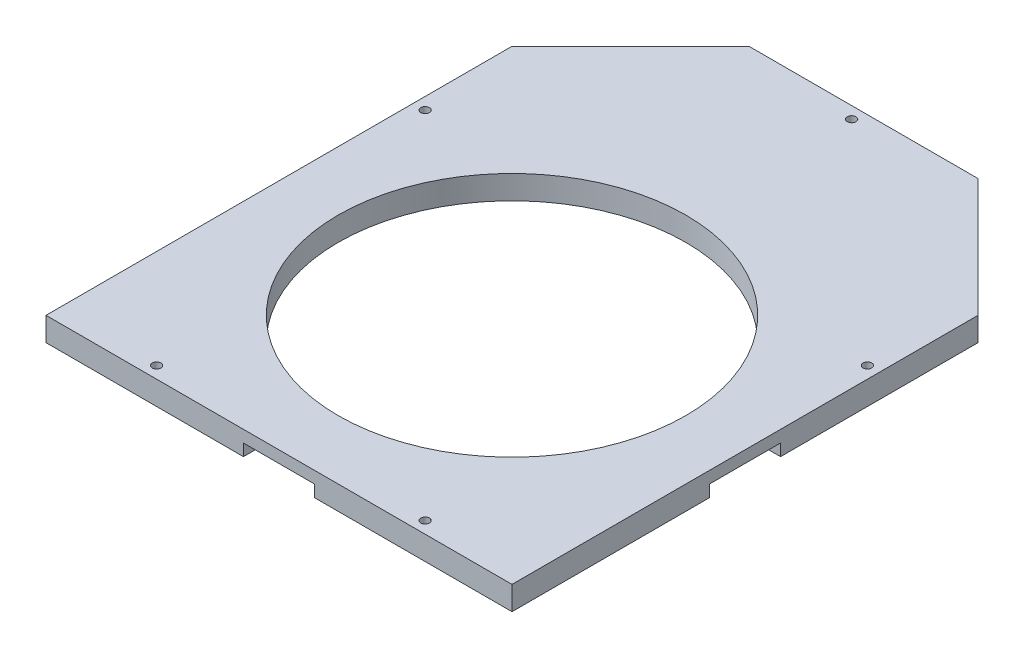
ISO-10303-21;
HEADER;
FILE_DESCRIPTION(('STEP AP214'),'2;1');
FILE_NAME('part.step','',(''),(''),'','','');
FILE_SCHEMA(('AUTOMOTIVE_DESIGN { 1 0 10303 214 1 1 1 1 }'));
ENDSEC;
DATA;
#1=APPLICATION_CONTEXT('core data for automotive mechanical design processes');
#2=APPLICATION_PROTOCOL_DEFINITION('international standard','automotive_design',2000,#1);
#3=PRODUCT_CONTEXT('',#1,'mechanical');
#4=PRODUCT('Part','Part','',(#3));
#5=PRODUCT_RELATED_PRODUCT_CATEGORY('part','',(#4));
#6=PRODUCT_DEFINITION_FORMATION('','',#4);
#7=PRODUCT_DEFINITION_CONTEXT('part definition',#1,'design');
#8=PRODUCT_DEFINITION('design','',#6,#7);
#9=PRODUCT_DEFINITION_SHAPE('','',#8);
#10=(LENGTH_UNIT() NAMED_UNIT(*) SI_UNIT(.MILLI.,.METRE.));
#11=(NAMED_UNIT(*) PLANE_ANGLE_UNIT() SI_UNIT($,.RADIAN.));
#12=(NAMED_UNIT(*) SI_UNIT($,.STERADIAN.) SOLID_ANGLE_UNIT());
#13=UNCERTAINTY_MEASURE_WITH_UNIT(LENGTH_MEASURE(1.E-05),#10,'distance_accuracy_value','');
#14=(GEOMETRIC_REPRESENTATION_CONTEXT(3) GLOBAL_UNCERTAINTY_ASSIGNED_CONTEXT((#13)) GLOBAL_UNIT_ASSIGNED_CONTEXT((#10,
#11,#12)) REPRESENTATION_CONTEXT('',''));
#15=CARTESIAN_POINT('',(0.,0.,0.));
#16=DIRECTION('',(0.,0.,1.));
#17=DIRECTION('',(1.,0.,0.));
#18=AXIS2_PLACEMENT_3D('',#15,#16,#17);
#19=CARTESIAN_POINT('',(0.,0.,0.));
#20=DIRECTION('',(0.,1.,0.));
#21=DIRECTION('',(0.,0.,1.));
#22=AXIS2_PLACEMENT_3D('',#19,#20,#21);
#23=PLANE('',#22);
#24=CARTESIAN_POINT('',(0.,0.,-86.));
#25=DIRECTION('',(0.,1.,0.));
#26=DIRECTION('',(0.,0.,1.));
#27=AXIS2_PLACEMENT_3D('',#24,#25,#26);
#28=CIRCLE('',#27,1.1);
#29=CARTESIAN_POINT('',(0.,0.,-84.9));
#30=VERTEX_POINT('',#29);
#31=EDGE_CURVE('E291',#30,#30,#28,.T.);
#32=ORIENTED_EDGE('',*,*,#31,.T.);
#33=EDGE_LOOP('',(#32));
#34=FACE_BOUND('',#33,.T.);
#35=CARTESIAN_POINT('',(-33.9999999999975,0.,55.9999999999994));
#36=DIRECTION('',(0.,1.,0.));
#37=DIRECTION('',(0.,0.,1.));
#38=AXIS2_PLACEMENT_3D('',#35,#36,#37);
#39=CIRCLE('',#38,1.10000000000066);
#40=CARTESIAN_POINT('',(-33.9999999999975,0.,57.1));
#41=VERTEX_POINT('',#40);
#42=EDGE_CURVE('E295',#41,#41,#39,.T.);
#43=ORIENTED_EDGE('',*,*,#42,.T.);
#44=EDGE_LOOP('',(#43));
#45=FACE_BOUND('',#44,.T.);
#46=CARTESIAN_POINT('',(56.,0.,-34.));
#47=DIRECTION('',(0.,1.,0.));
#48=DIRECTION('',(0.,0.,-1.));
#49=AXIS2_PLACEMENT_3D('',#46,#47,#48);
#50=CIRCLE('',#49,1.1);
#51=CARTESIAN_POINT('',(56.,0.,-35.1));
#52=VERTEX_POINT('',#51);
#53=EDGE_CURVE('E301',#52,#52,#50,.T.);
#54=ORIENTED_EDGE('',*,*,#53,.T.);
#55=EDGE_LOOP('',(#54));
#56=FACE_BOUND('',#55,.T.);
#57=CARTESIAN_POINT('',(33.9999999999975,0.,55.9999999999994));
#58=DIRECTION('',(0.,1.,0.));
#59=DIRECTION('',(0.,0.,-1.));
#60=AXIS2_PLACEMENT_3D('',#57,#58,#59);
#61=CIRCLE('',#60,1.10000000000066);
#62=CARTESIAN_POINT('',(33.9999999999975,0.,54.8999999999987));
#63=VERTEX_POINT('',#62);
#64=EDGE_CURVE('E307',#63,#63,#61,.T.);
#65=ORIENTED_EDGE('',*,*,#64,.T.);
#66=EDGE_LOOP('',(#65));
#67=FACE_BOUND('',#66,.T.);
#68=CARTESIAN_POINT('',(-56.,0.,-34.));
#69=DIRECTION('',(0.,1.,0.));
#70=DIRECTION('',(0.,0.,1.));
#71=AXIS2_PLACEMENT_3D('',#68,#69,#70);
#72=CIRCLE('',#71,1.1);
#73=CARTESIAN_POINT('',(-56.,0.,-32.9));
#74=VERTEX_POINT('',#73);
#75=EDGE_CURVE('E313',#74,#74,#72,.T.);
#76=ORIENTED_EDGE('',*,*,#75,.T.);
#77=EDGE_LOOP('',(#76));
#78=FACE_BOUND('',#77,.T.);
#79=CARTESIAN_POINT('',(0.,0.,0.));
#80=DIRECTION('',(0.,1.,0.));
#81=DIRECTION('',(0.,0.,1.));
#82=AXIS2_PLACEMENT_3D('',#79,#80,#81);
#83=CIRCLE('',#82,44.);
#84=CARTESIAN_POINT('',(0.,0.,44.));
#85=VERTEX_POINT('',#84);
#86=EDGE_CURVE('E319',#85,#85,#83,.T.);
#87=ORIENTED_EDGE('',*,*,#86,.T.);
#88=EDGE_LOOP('',(#87));
#89=FACE_BOUND('',#88,.T.);
#90=DIRECTION('',(-1.,0.,0.));
#91=VECTOR('',#90,1.);
#92=CARTESIAN_POINT('',(-55.2627416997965,0.,-9.00000000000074));
#93=LINE('',#92,#91);
#94=CARTESIAN_POINT('',(-55.2627416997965,0.,-9.00000000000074));
#95=VERTEX_POINT('',#94);
#96=CARTESIAN_POINT('',(-59.,0.,-9.00000000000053));
#97=VERTEX_POINT('',#96);
#98=EDGE_CURVE('E418',#95,#97,#93,.T.);
#99=ORIENTED_EDGE('',*,*,#98,.T.);
#100=DIRECTION('',(0.,0.,1.));
#101=VECTOR('',#100,1.);
#102=CARTESIAN_POINT('',(-59.,0.,-59.));
#103=LINE('',#102,#101);
#104=CARTESIAN_POINT('',(-59.,0.,-59.));
#105=VERTEX_POINT('',#104);
#106=EDGE_CURVE('E353',#105,#97,#103,.T.);
#107=ORIENTED_EDGE('',*,*,#106,.F.);
#108=DIRECTION('',(-0.707106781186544,0.,0.707106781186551));
#109=VECTOR('',#108,1.);
#110=CARTESIAN_POINT('',(-59.,0.,-59.));
#111=LINE('',#110,#109);
#112=CARTESIAN_POINT('',(-29.0000000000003,0.,-89.));
#113=VERTEX_POINT('',#112);
#114=EDGE_CURVE('E350',#113,#105,#111,.T.);
#115=ORIENTED_EDGE('',*,*,#114,.F.);
#116=DIRECTION('',(-1.,0.,0.));
#117=VECTOR('',#116,1.);
#118=CARTESIAN_POINT('',(-29.0000000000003,0.,-89.));
#119=LINE('',#118,#117);
#120=CARTESIAN_POINT('',(29.0000000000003,0.,-89.));
#121=VERTEX_POINT('',#120);
#122=EDGE_CURVE('E348',#121,#113,#119,.T.);
#123=ORIENTED_EDGE('',*,*,#122,.F.);
#124=DIRECTION('',(-0.707106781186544,0.,-0.707106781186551));
#125=VECTOR('',#124,1.);
#126=CARTESIAN_POINT('',(59.,0.,-59.));
#127=LINE('',#126,#125);
#128=CARTESIAN_POINT('',(59.,0.,-59.));
#129=VERTEX_POINT('',#128);
#130=EDGE_CURVE('E346',#129,#121,#127,.T.);
#131=ORIENTED_EDGE('',*,*,#130,.F.);
#132=DIRECTION('',(0.,0.,-1.));
#133=VECTOR('',#132,1.);
#134=CARTESIAN_POINT('',(59.,0.,-59.));
#135=LINE('',#134,#133);
#136=CARTESIAN_POINT('',(59.,0.,-9.));
#137=VERTEX_POINT('',#136);
#138=EDGE_CURVE('E325',#137,#129,#135,.T.);
#139=ORIENTED_EDGE('',*,*,#138,.F.);
#140=DIRECTION('',(-1.,0.,0.));
#141=VECTOR('',#140,1.);
#142=CARTESIAN_POINT('',(55.2627416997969,0.,-8.99999999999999));
#143=LINE('',#142,#141);
#144=CARTESIAN_POINT('',(55.2627416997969,0.,-8.99999999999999));
#145=VERTEX_POINT('',#144);
#146=EDGE_CURVE('E260',#137,#145,#143,.T.);
#147=ORIENTED_EDGE('',*,*,#146,.T.);
#148=CARTESIAN_POINT('',(54.1313708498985,0.,-7.86862915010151));
#149=DIRECTION('',(0.,1.,0.));
#150=DIRECTION('',(0.,0.,1.));
#151=AXIS2_PLACEMENT_3D('',#148,#149,#150);
#152=CIRCLE('',#151,1.6);
#153=CARTESIAN_POINT('',(53.,0.,-6.73725830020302));
#154=VERTEX_POINT('',#153);
#155=EDGE_CURVE('E255',#145,#154,#152,.T.);
#156=ORIENTED_EDGE('',*,*,#155,.T.);
#157=DIRECTION('',(0.,0.,1.));
#158=VECTOR('',#157,1.);
#159=CARTESIAN_POINT('',(53.,0.,-6.73725830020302));
#160=LINE('',#159,#158);
#161=CARTESIAN_POINT('',(53.,0.,6.73725830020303));
#162=VERTEX_POINT('',#161);
#163=EDGE_CURVE('E272',#154,#162,#160,.T.);
#164=ORIENTED_EDGE('',*,*,#163,.T.);
#165=CARTESIAN_POINT('',(54.1313708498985,0.,7.86862915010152));
#166=DIRECTION('',(0.,1.,0.));
#167=DIRECTION('',(0.,0.,-1.));
#168=AXIS2_PLACEMENT_3D('',#165,#166,#167);
#169=CIRCLE('',#168,1.6);
#170=CARTESIAN_POINT('',(55.2627416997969,0.,9.00000000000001));
#171=VERTEX_POINT('',#170);
#172=EDGE_CURVE('E275',#162,#171,#169,.T.);
#173=ORIENTED_EDGE('',*,*,#172,.T.);
#174=DIRECTION('',(1.,0.,0.));
#175=VECTOR('',#174,1.);
#176=CARTESIAN_POINT('',(55.2627416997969,0.,9.00000000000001));
#177=LINE('',#176,#175);
#178=CARTESIAN_POINT('',(59.,0.,9.));
#179=VERTEX_POINT('',#178);
#180=EDGE_CURVE('E278',#171,#179,#177,.T.);
#181=ORIENTED_EDGE('',*,*,#180,.T.);
#182=CARTESIAN_POINT('',(59.,0.,59.));
#183=VERTEX_POINT('',#182);
#184=EDGE_CURVE('E343',#183,#179,#135,.T.);
#185=ORIENTED_EDGE('',*,*,#184,.F.);
#186=DIRECTION('',(1.,0.,0.));
#187=VECTOR('',#186,1.);
#188=CARTESIAN_POINT('',(-59.,0.,59.));
#189=LINE('',#188,#187);
#190=CARTESIAN_POINT('',(8.9999999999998,0.,59.));
#191=VERTEX_POINT('',#190);
#192=EDGE_CURVE('E356',#191,#183,#189,.T.);
#193=ORIENTED_EDGE('',*,*,#192,.F.);
#194=DIRECTION('',(0.,0.,-1.));
#195=VECTOR('',#194,1.);
#196=CARTESIAN_POINT('',(8.99999999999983,0.,55.2627416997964));
#197=LINE('',#196,#195);
#198=CARTESIAN_POINT('',(8.99999999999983,0.,55.2627416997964));
#199=VERTEX_POINT('',#198);
#200=EDGE_CURVE('E228',#191,#199,#197,.T.);
#201=ORIENTED_EDGE('',*,*,#200,.T.);
#202=CARTESIAN_POINT('',(7.86862915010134,0.,54.1313708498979));
#203=DIRECTION('',(0.,1.,0.));
#204=DIRECTION('',(0.,0.,1.));
#205=AXIS2_PLACEMENT_3D('',#202,#203,#204);
#206=CIRCLE('',#205,1.6);
#207=CARTESIAN_POINT('',(6.73725830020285,0.,52.9999999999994));
#208=VERTEX_POINT('',#207);
#209=EDGE_CURVE('E214',#199,#208,#206,.T.);
#210=ORIENTED_EDGE('',*,*,#209,.T.);
#211=DIRECTION('',(-1.,0.,0.));
#212=VECTOR('',#211,1.);
#213=CARTESIAN_POINT('',(6.73725830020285,0.,52.9999999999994));
#214=LINE('',#213,#212);
#215=CARTESIAN_POINT('',(-6.7372583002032,0.,52.9999999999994));
#216=VERTEX_POINT('',#215);
#217=EDGE_CURVE('E218',#208,#216,#214,.T.);
#218=ORIENTED_EDGE('',*,*,#217,.T.);
#219=CARTESIAN_POINT('',(-7.86862915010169,0.,54.1313708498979));
#220=DIRECTION('',(0.,1.,0.));
#221=DIRECTION('',(0.,0.,-1.));
#222=AXIS2_PLACEMENT_3D('',#219,#220,#221);
#223=CIRCLE('',#222,1.6);
#224=CARTESIAN_POINT('',(-9.00000000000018,0.,55.2627416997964));
#225=VERTEX_POINT('',#224);
#226=EDGE_CURVE('E239',#216,#225,#223,.T.);
#227=ORIENTED_EDGE('',*,*,#226,.T.);
#228=DIRECTION('',(0.,0.,1.));
#229=VECTOR('',#228,1.);
#230=CARTESIAN_POINT('',(-9.00000000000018,0.,55.2627416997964));
#231=LINE('',#230,#229);
#232=CARTESIAN_POINT('',(-9.0000000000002,0.,59.));
#233=VERTEX_POINT('',#232);
#234=EDGE_CURVE('E242',#225,#233,#231,.T.);
#235=ORIENTED_EDGE('',*,*,#234,.T.);
#236=CARTESIAN_POINT('',(-59.,0.,59.));
#237=VERTEX_POINT('',#236);
#238=EDGE_CURVE('E332',#237,#233,#189,.T.);
#239=ORIENTED_EDGE('',*,*,#238,.F.);
#240=CARTESIAN_POINT('',(-59.,0.,8.99999999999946));
#241=VERTEX_POINT('',#240);
#242=EDGE_CURVE('E352',#241,#237,#103,.T.);
#243=ORIENTED_EDGE('',*,*,#242,.F.);
#244=DIRECTION('',(1.,0.,0.));
#245=VECTOR('',#244,1.);
#246=CARTESIAN_POINT('',(-55.2627416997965,0.,8.99999999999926));
#247=LINE('',#246,#245);
#248=CARTESIAN_POINT('',(-55.2627416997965,0.,8.99999999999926));
#249=VERTEX_POINT('',#248);
#250=EDGE_CURVE('E209',#241,#249,#247,.T.);
#251=ORIENTED_EDGE('',*,*,#250,.T.);
#252=CARTESIAN_POINT('',(-54.1313708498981,0.,7.86862915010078));
#253=DIRECTION('',(0.,1.,0.));
#254=DIRECTION('',(0.,0.,1.));
#255=AXIS2_PLACEMENT_3D('',#252,#253,#254);
#256=CIRCLE('',#255,1.6);
#257=CARTESIAN_POINT('',(-52.9999999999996,0.,6.73725830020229));
#258=VERTEX_POINT('',#257);
#259=EDGE_CURVE('E412',#249,#258,#256,.T.);
#260=ORIENTED_EDGE('',*,*,#259,.T.);
#261=DIRECTION('',(0.,0.,-1.));
#262=VECTOR('',#261,1.);
#263=CARTESIAN_POINT('',(-52.9999999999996,0.,6.73725830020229));
#264=LINE('',#263,#262);
#265=CARTESIAN_POINT('',(-52.9999999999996,0.,-6.73725830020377));
#266=VERTEX_POINT('',#265);
#267=EDGE_CURVE('E213',#258,#266,#264,.T.);
#268=ORIENTED_EDGE('',*,*,#267,.T.);
#269=CARTESIAN_POINT('',(-54.1313708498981,0.,-7.86862915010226));
#270=DIRECTION('',(0.,1.,0.));
#271=DIRECTION('',(0.,0.,-1.));
#272=AXIS2_PLACEMENT_3D('',#269,#270,#271);
#273=CIRCLE('',#272,1.6);
#274=EDGE_CURVE('E415',#266,#95,#273,.T.);
#275=ORIENTED_EDGE('',*,*,#274,.T.);
#276=EDGE_LOOP('',(#99,#107,#115,#123,#131,#139,#147,#156,#164,#173,#181,#185,#193,#201,#210,
#218,#227,#235,#239,#243,#251,#260,#268,#275));
#277=FACE_BOUND('',#276,.T.);
#278=ADVANCED_FACE('F33',(#34,#45,#56,#67,#78,#89,#277),#23,.F.);
#279=CARTESIAN_POINT('',(-59.,6.,-59.));
#280=DIRECTION('',(1.,0.,0.));
#281=DIRECTION('',(0.,0.,-1.));
#282=AXIS2_PLACEMENT_3D('',#279,#280,#281);
#283=PLANE('',#282);
#284=DIRECTION('',(0.,-1.,0.));
#285=VECTOR('',#284,1.);
#286=CARTESIAN_POINT('',(-59.,6.,-9.00000000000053));
#287=LINE('',#286,#285);
#288=CARTESIAN_POINT('',(-59.,3.,-9.00000000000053));
#289=VERTEX_POINT('',#288);
#290=EDGE_CURVE('E11',#289,#97,#287,.T.);
#291=ORIENTED_EDGE('',*,*,#290,.F.);
#292=DIRECTION('',(0.,0.,1.));
#293=VECTOR('',#292,1.);
#294=CARTESIAN_POINT('',(-59.,3.,-59.));
#295=LINE('',#294,#293);
#296=CARTESIAN_POINT('',(-59.,3.,8.99999999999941));
#297=VERTEX_POINT('',#296);
#298=EDGE_CURVE('E391',#289,#297,#295,.T.);
#299=ORIENTED_EDGE('',*,*,#298,.T.);
#300=DIRECTION('',(0.,1.,0.));
#301=VECTOR('',#300,1.);
#302=CARTESIAN_POINT('',(-59.,6.,8.99999999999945));
#303=LINE('',#302,#301);
#304=EDGE_CURVE('E41',#241,#297,#303,.T.);
#305=ORIENTED_EDGE('',*,*,#304,.F.);
#306=ORIENTED_EDGE('',*,*,#242,.T.);
#307=DIRECTION('',(0.,-1.,0.));
#308=VECTOR('',#307,1.);
#309=CARTESIAN_POINT('',(-59.,6.,59.));
#310=LINE('',#309,#308);
#311=CARTESIAN_POINT('',(-59.,6.,59.));
#312=VERTEX_POINT('',#311);
#313=EDGE_CURVE('E361',#312,#237,#310,.T.);
#314=ORIENTED_EDGE('',*,*,#313,.F.);
#315=DIRECTION('',(0.,0.,1.));
#316=VECTOR('',#315,1.);
#317=CARTESIAN_POINT('',(-59.,6.,-59.));
#318=LINE('',#317,#316);
#319=CARTESIAN_POINT('',(-59.,6.,-59.));
#320=VERTEX_POINT('',#319);
#321=EDGE_CURVE('E338',#320,#312,#318,.T.);
#322=ORIENTED_EDGE('',*,*,#321,.F.);
#323=DIRECTION('',(0.,-1.,0.));
#324=VECTOR('',#323,1.);
#325=CARTESIAN_POINT('',(-59.,6.,-59.));
#326=LINE('',#325,#324);
#327=EDGE_CURVE('E364',#320,#105,#326,.T.);
#328=ORIENTED_EDGE('',*,*,#327,.T.);
#329=ORIENTED_EDGE('',*,*,#106,.T.);
#330=EDGE_LOOP('',(#291,#299,#305,#306,#314,#322,#328,#329));
#331=FACE_BOUND('',#330,.T.);
#332=ADVANCED_FACE('F400',(#331),#283,.F.);
#333=CARTESIAN_POINT('',(-59.,6.,59.));
#334=DIRECTION('',(0.,0.,-1.));
#335=DIRECTION('',(-1.,0.,0.));
#336=AXIS2_PLACEMENT_3D('',#333,#334,#335);
#337=PLANE('',#336);
#338=DIRECTION('',(0.,-1.,0.));
#339=VECTOR('',#338,1.);
#340=CARTESIAN_POINT('',(-9.0000000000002,6.,59.));
#341=LINE('',#340,#339);
#342=CARTESIAN_POINT('',(-9.0000000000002,3.,59.));
#343=VERTEX_POINT('',#342);
#344=EDGE_CURVE('E389',#343,#233,#341,.T.);
#345=ORIENTED_EDGE('',*,*,#344,.F.);
#346=DIRECTION('',(1.,0.,0.));
#347=VECTOR('',#346,1.);
#348=CARTESIAN_POINT('',(-59.,3.,59.));
#349=LINE('',#348,#347);
#350=CARTESIAN_POINT('',(8.9999999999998,3.,59.));
#351=VERTEX_POINT('',#350);
#352=EDGE_CURVE('E384',#343,#351,#349,.T.);
#353=ORIENTED_EDGE('',*,*,#352,.T.);
#354=DIRECTION('',(0.,1.,0.));
#355=VECTOR('',#354,1.);
#356=CARTESIAN_POINT('',(8.9999999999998,6.,59.));
#357=LINE('',#356,#355);
#358=EDGE_CURVE('E387',#191,#351,#357,.T.);
#359=ORIENTED_EDGE('',*,*,#358,.F.);
#360=ORIENTED_EDGE('',*,*,#192,.T.);
#361=DIRECTION('',(0.,-1.,0.));
#362=VECTOR('',#361,1.);
#363=CARTESIAN_POINT('',(59.,6.,59.));
#364=LINE('',#363,#362);
#365=CARTESIAN_POINT('',(59.,6.,59.));
#366=VERTEX_POINT('',#365);
#367=EDGE_CURVE('E342',#366,#183,#364,.T.);
#368=ORIENTED_EDGE('',*,*,#367,.F.);
#369=DIRECTION('',(1.,0.,0.));
#370=VECTOR('',#369,1.);
#371=CARTESIAN_POINT('',(-59.,6.,59.));
#372=LINE('',#371,#370);
#373=EDGE_CURVE('E340',#312,#366,#372,.T.);
#374=ORIENTED_EDGE('',*,*,#373,.F.);
#375=ORIENTED_EDGE('',*,*,#313,.T.);
#376=ORIENTED_EDGE('',*,*,#238,.T.);
#377=EDGE_LOOP('',(#345,#353,#359,#360,#368,#374,#375,#376));
#378=FACE_BOUND('',#377,.T.);
#379=ADVANCED_FACE('F432',(#378),#337,.F.);
#380=CARTESIAN_POINT('',(59.,6.,-59.));
#381=DIRECTION('',(-1.,0.,0.));
#382=DIRECTION('',(0.,0.,1.));
#383=AXIS2_PLACEMENT_3D('',#380,#381,#382);
#384=PLANE('',#383);
#385=DIRECTION('',(0.,-1.,0.));
#386=VECTOR('',#385,1.);
#387=CARTESIAN_POINT('',(59.,6.,9.00000000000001));
#388=LINE('',#387,#386);
#389=CARTESIAN_POINT('',(59.,3.,9.));
#390=VERTEX_POINT('',#389);
#391=EDGE_CURVE('E382',#390,#179,#388,.T.);
#392=ORIENTED_EDGE('',*,*,#391,.F.);
#393=DIRECTION('',(0.,0.,-1.));
#394=VECTOR('',#393,1.);
#395=CARTESIAN_POINT('',(59.,3.,-59.));
#396=LINE('',#395,#394);
#397=CARTESIAN_POINT('',(59.,3.,-8.99999999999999));
#398=VERTEX_POINT('',#397);
#399=EDGE_CURVE('E376',#390,#398,#396,.T.);
#400=ORIENTED_EDGE('',*,*,#399,.T.);
#401=DIRECTION('',(0.,1.,0.));
#402=VECTOR('',#401,1.);
#403=CARTESIAN_POINT('',(59.,6.,-8.99999999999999));
#404=LINE('',#403,#402);
#405=EDGE_CURVE('E379',#137,#398,#404,.T.);
#406=ORIENTED_EDGE('',*,*,#405,.F.);
#407=ORIENTED_EDGE('',*,*,#138,.T.);
#408=DIRECTION('',(0.,-1.,0.));
#409=VECTOR('',#408,1.);
#410=CARTESIAN_POINT('',(59.,6.,-59.));
#411=LINE('',#410,#409);
#412=CARTESIAN_POINT('',(59.,6.,-59.));
#413=VERTEX_POINT('',#412);
#414=EDGE_CURVE('E373',#413,#129,#411,.T.);
#415=ORIENTED_EDGE('',*,*,#414,.F.);
#416=DIRECTION('',(0.,0.,-1.));
#417=VECTOR('',#416,1.);
#418=CARTESIAN_POINT('',(59.,6.,-59.));
#419=LINE('',#418,#417);
#420=EDGE_CURVE('E328',#366,#413,#419,.T.);
#421=ORIENTED_EDGE('',*,*,#420,.F.);
#422=ORIENTED_EDGE('',*,*,#367,.T.);
#423=ORIENTED_EDGE('',*,*,#184,.T.);
#424=EDGE_LOOP('',(#392,#400,#406,#407,#415,#421,#422,#423));
#425=FACE_BOUND('',#424,.T.);
#426=ADVANCED_FACE('F35',(#425),#384,.F.);
#427=CARTESIAN_POINT('',(0.,6.,0.));
#428=DIRECTION('',(0.,1.,0.));
#429=DIRECTION('',(0.,0.,1.));
#430=AXIS2_PLACEMENT_3D('',#427,#428,#429);
#431=PLANE('',#430);
#432=CARTESIAN_POINT('',(-33.9999999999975,6.,55.9999999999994));
#433=DIRECTION('',(0.,1.,0.));
#434=DIRECTION('',(0.,0.,1.));
#435=AXIS2_PLACEMENT_3D('',#432,#433,#434);
#436=CIRCLE('',#435,1.10000000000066);
#437=CARTESIAN_POINT('',(-33.9999999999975,6.,57.1));
#438=VERTEX_POINT('',#437);
#439=EDGE_CURVE('E298',#438,#438,#436,.T.);
#440=ORIENTED_EDGE('',*,*,#439,.F.);
#441=EDGE_LOOP('',(#440));
#442=FACE_BOUND('',#441,.T.);
#443=CARTESIAN_POINT('',(33.9999999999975,6.,55.9999999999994));
#444=DIRECTION('',(0.,1.,0.));
#445=DIRECTION('',(0.,0.,-1.));
#446=AXIS2_PLACEMENT_3D('',#443,#444,#445);
#447=CIRCLE('',#446,1.10000000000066);
#448=CARTESIAN_POINT('',(33.9999999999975,6.,54.8999999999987));
#449=VERTEX_POINT('',#448);
#450=EDGE_CURVE('E310',#449,#449,#447,.T.);
#451=ORIENTED_EDGE('',*,*,#450,.F.);
#452=EDGE_LOOP('',(#451));
#453=FACE_BOUND('',#452,.T.);
#454=CARTESIAN_POINT('',(0.,6.,0.));
#455=DIRECTION('',(0.,1.,0.));
#456=DIRECTION('',(0.,0.,1.));
#457=AXIS2_PLACEMENT_3D('',#454,#455,#456);
#458=CIRCLE('',#457,44.);
#459=CARTESIAN_POINT('',(0.,6.,44.));
#460=VERTEX_POINT('',#459);
#461=EDGE_CURVE('E322',#460,#460,#458,.T.);
#462=ORIENTED_EDGE('',*,*,#461,.F.);
#463=EDGE_LOOP('',(#462));
#464=FACE_BOUND('',#463,.T.);
#465=ORIENTED_EDGE('',*,*,#420,.T.);
#466=DIRECTION('',(-0.707106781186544,0.,-0.707106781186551));
#467=VECTOR('',#466,1.);
#468=CARTESIAN_POINT('',(59.,6.,-59.));
#469=LINE('',#468,#467);
#470=CARTESIAN_POINT('',(29.0000000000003,6.,-89.));
#471=VERTEX_POINT('',#470);
#472=EDGE_CURVE('E331',#413,#471,#469,.T.);
#473=ORIENTED_EDGE('',*,*,#472,.T.);
#474=DIRECTION('',(-1.,0.,0.));
#475=VECTOR('',#474,1.);
#476=CARTESIAN_POINT('',(-29.0000000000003,6.,-89.));
#477=LINE('',#476,#475);
#478=CARTESIAN_POINT('',(-29.0000000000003,6.,-89.));
#479=VERTEX_POINT('',#478);
#480=EDGE_CURVE('E334',#471,#479,#477,.T.);
#481=ORIENTED_EDGE('',*,*,#480,.T.);
#482=DIRECTION('',(-0.707106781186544,0.,0.707106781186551));
#483=VECTOR('',#482,1.);
#484=CARTESIAN_POINT('',(-59.,6.,-59.));
#485=LINE('',#484,#483);
#486=EDGE_CURVE('E336',#479,#320,#485,.T.);
#487=ORIENTED_EDGE('',*,*,#486,.T.);
#488=ORIENTED_EDGE('',*,*,#321,.T.);
#489=ORIENTED_EDGE('',*,*,#373,.T.);
#490=EDGE_LOOP('',(#465,#473,#481,#487,#488,#489));
#491=FACE_BOUND('',#490,.T.);
#492=CARTESIAN_POINT('',(-56.,6.,-34.));
#493=DIRECTION('',(0.,1.,0.));
#494=DIRECTION('',(0.,0.,1.));
#495=AXIS2_PLACEMENT_3D('',#492,#493,#494);
#496=CIRCLE('',#495,1.1);
#497=CARTESIAN_POINT('',(-56.,6.,-32.9));
#498=VERTEX_POINT('',#497);
#499=EDGE_CURVE('E316',#498,#498,#496,.T.);
#500=ORIENTED_EDGE('',*,*,#499,.F.);
#501=EDGE_LOOP('',(#500));
#502=FACE_BOUND('',#501,.T.);
#503=CARTESIAN_POINT('',(56.,6.,-34.));
#504=DIRECTION('',(0.,1.,0.));
#505=DIRECTION('',(0.,0.,-1.));
#506=AXIS2_PLACEMENT_3D('',#503,#504,#505);
#507=CIRCLE('',#506,1.1);
#508=CARTESIAN_POINT('',(56.,6.,-35.1));
#509=VERTEX_POINT('',#508);
#510=EDGE_CURVE('E304',#509,#509,#507,.T.);
#511=ORIENTED_EDGE('',*,*,#510,.F.);
#512=EDGE_LOOP('',(#511));
#513=FACE_BOUND('',#512,.T.);
#514=CARTESIAN_POINT('',(0.,6.,-86.));
#515=DIRECTION('',(0.,1.,0.));
#516=DIRECTION('',(0.,0.,1.));
#517=AXIS2_PLACEMENT_3D('',#514,#515,#516);
#518=CIRCLE('',#517,1.1);
#519=CARTESIAN_POINT('',(0.,6.,-84.9));
#520=VERTEX_POINT('',#519);
#521=EDGE_CURVE('E292',#520,#520,#518,.T.);
#522=ORIENTED_EDGE('',*,*,#521,.F.);
#523=EDGE_LOOP('',(#522));
#524=FACE_BOUND('',#523,.T.);
#525=ADVANCED_FACE('F436',(#442,#453,#464,#491,#502,#513,#524),#431,.T.);
#526=CARTESIAN_POINT('',(59.,6.,-59.));
#527=DIRECTION('',(-0.707106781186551,0.,0.707106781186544));
#528=DIRECTION('',(0.707106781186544,0.,0.707106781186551));
#529=AXIS2_PLACEMENT_3D('',#526,#527,#528);
#530=PLANE('',#529);
#531=ORIENTED_EDGE('',*,*,#130,.T.);
#532=DIRECTION('',(0.,-1.,0.));
#533=VECTOR('',#532,1.);
#534=CARTESIAN_POINT('',(29.0000000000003,6.,-89.));
#535=LINE('',#534,#533);
#536=EDGE_CURVE('E370',#471,#121,#535,.T.);
#537=ORIENTED_EDGE('',*,*,#536,.F.);
#538=ORIENTED_EDGE('',*,*,#472,.F.);
#539=ORIENTED_EDGE('',*,*,#414,.T.);
#540=EDGE_LOOP('',(#531,#537,#538,#539));
#541=FACE_BOUND('',#540,.T.);
#542=ADVANCED_FACE('F452',(#541),#530,.F.);
#543=CARTESIAN_POINT('',(-29.0000000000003,6.,-89.));
#544=DIRECTION('',(0.,0.,1.));
#545=DIRECTION('',(1.,0.,0.));
#546=AXIS2_PLACEMENT_3D('',#543,#544,#545);
#547=PLANE('',#546);
#548=ORIENTED_EDGE('',*,*,#122,.T.);
#549=DIRECTION('',(0.,-1.,0.));
#550=VECTOR('',#549,1.);
#551=CARTESIAN_POINT('',(-29.0000000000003,6.,-89.));
#552=LINE('',#551,#550);
#553=EDGE_CURVE('E367',#479,#113,#552,.T.);
#554=ORIENTED_EDGE('',*,*,#553,.F.);
#555=ORIENTED_EDGE('',*,*,#480,.F.);
#556=ORIENTED_EDGE('',*,*,#536,.T.);
#557=EDGE_LOOP('',(#548,#554,#555,#556));
#558=FACE_BOUND('',#557,.T.);
#559=ADVANCED_FACE('F449',(#558),#547,.F.);
#560=CARTESIAN_POINT('',(-59.,6.,-59.));
#561=DIRECTION('',(0.707106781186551,0.,0.707106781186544));
#562=DIRECTION('',(0.707106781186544,0.,-0.707106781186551));
#563=AXIS2_PLACEMENT_3D('',#560,#561,#562);
#564=PLANE('',#563);
#565=ORIENTED_EDGE('',*,*,#114,.T.);
#566=ORIENTED_EDGE('',*,*,#327,.F.);
#567=ORIENTED_EDGE('',*,*,#486,.F.);
#568=ORIENTED_EDGE('',*,*,#553,.T.);
#569=EDGE_LOOP('',(#565,#566,#567,#568));
#570=FACE_BOUND('',#569,.T.);
#571=ADVANCED_FACE('F445',(#570),#564,.F.);
#572=CARTESIAN_POINT('',(0.,6.,0.));
#573=DIRECTION('',(0.,-1.,0.));
#574=DIRECTION('',(0.,0.,-1.));
#575=AXIS2_PLACEMENT_3D('',#572,#573,#574);
#576=CYLINDRICAL_SURFACE('',#575,44.);
#577=ORIENTED_EDGE('',*,*,#461,.T.);
#578=EDGE_LOOP('',(#577));
#579=FACE_BOUND('',#578,.T.);
#580=ORIENTED_EDGE('',*,*,#86,.F.);
#581=EDGE_LOOP('',(#580));
#582=FACE_BOUND('',#581,.T.);
#583=ADVANCED_FACE('F524',(#579,#582),#576,.F.);
#584=CARTESIAN_POINT('',(-56.,6.,-34.));
#585=DIRECTION('',(0.,-1.,0.));
#586=DIRECTION('',(0.,0.,-1.));
#587=AXIS2_PLACEMENT_3D('',#584,#585,#586);
#588=CYLINDRICAL_SURFACE('',#587,1.1);
#589=ORIENTED_EDGE('',*,*,#499,.T.);
#590=EDGE_LOOP('',(#589));
#591=FACE_BOUND('',#590,.T.);
#592=ORIENTED_EDGE('',*,*,#75,.F.);
#593=EDGE_LOOP('',(#592));
#594=FACE_BOUND('',#593,.T.);
#595=ADVANCED_FACE('F542',(#591,#594),#588,.F.);
#596=CARTESIAN_POINT('',(33.9999999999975,6.,55.9999999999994));
#597=DIRECTION('',(0.,-1.,0.));
#598=DIRECTION('',(0.,0.,-1.));
#599=AXIS2_PLACEMENT_3D('',#596,#597,#598);
#600=CYLINDRICAL_SURFACE('',#599,1.10000000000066);
#601=ORIENTED_EDGE('',*,*,#450,.T.);
#602=EDGE_LOOP('',(#601));
#603=FACE_BOUND('',#602,.T.);
#604=ORIENTED_EDGE('',*,*,#64,.F.);
#605=EDGE_LOOP('',(#604));
#606=FACE_BOUND('',#605,.T.);
#607=ADVANCED_FACE('F548',(#603,#606),#600,.F.);
#608=CARTESIAN_POINT('',(56.,6.,-34.));
#609=DIRECTION('',(0.,-1.,0.));
#610=DIRECTION('',(0.,0.,-1.));
#611=AXIS2_PLACEMENT_3D('',#608,#609,#610);
#612=CYLINDRICAL_SURFACE('',#611,1.1);
#613=ORIENTED_EDGE('',*,*,#510,.T.);
#614=EDGE_LOOP('',(#613));
#615=FACE_BOUND('',#614,.T.);
#616=ORIENTED_EDGE('',*,*,#53,.F.);
#617=EDGE_LOOP('',(#616));
#618=FACE_BOUND('',#617,.T.);
#619=ADVANCED_FACE('F554',(#615,#618),#612,.F.);
#620=CARTESIAN_POINT('',(-33.9999999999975,6.,55.9999999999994));
#621=DIRECTION('',(0.,-1.,0.));
#622=DIRECTION('',(0.,0.,-1.));
#623=AXIS2_PLACEMENT_3D('',#620,#621,#622);
#624=CYLINDRICAL_SURFACE('',#623,1.10000000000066);
#625=ORIENTED_EDGE('',*,*,#439,.T.);
#626=EDGE_LOOP('',(#625));
#627=FACE_BOUND('',#626,.T.);
#628=ORIENTED_EDGE('',*,*,#42,.F.);
#629=EDGE_LOOP('',(#628));
#630=FACE_BOUND('',#629,.T.);
#631=ADVANCED_FACE('F558',(#627,#630),#624,.F.);
#632=CARTESIAN_POINT('',(0.,6.,-86.));
#633=DIRECTION('',(0.,-1.,0.));
#634=DIRECTION('',(0.,0.,-1.));
#635=AXIS2_PLACEMENT_3D('',#632,#633,#634);
#636=CYLINDRICAL_SURFACE('',#635,1.1);
#637=ORIENTED_EDGE('',*,*,#521,.T.);
#638=EDGE_LOOP('',(#637));
#639=FACE_BOUND('',#638,.T.);
#640=ORIENTED_EDGE('',*,*,#31,.F.);
#641=EDGE_LOOP('',(#640));
#642=FACE_BOUND('',#641,.T.);
#643=ADVANCED_FACE('F562',(#639,#642),#636,.F.);
#644=CARTESIAN_POINT('',(55.2627416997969,3.,9.00000000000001));
#645=DIRECTION('',(0.,0.,-1.));
#646=DIRECTION('',(-1.,0.,0.));
#647=AXIS2_PLACEMENT_3D('',#644,#645,#646);
#648=PLANE('',#647);
#649=ORIENTED_EDGE('',*,*,#391,.T.);
#650=ORIENTED_EDGE('',*,*,#180,.F.);
#651=DIRECTION('',(0.,-1.,0.));
#652=VECTOR('',#651,1.);
#653=CARTESIAN_POINT('',(55.2627416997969,3.,9.00000000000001));
#654=LINE('',#653,#652);
#655=CARTESIAN_POINT('',(55.2627416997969,3.,9.00000000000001));
#656=VERTEX_POINT('',#655);
#657=EDGE_CURVE('E284',#656,#171,#654,.T.);
#658=ORIENTED_EDGE('',*,*,#657,.F.);
#659=DIRECTION('',(1.,0.,0.));
#660=VECTOR('',#659,1.);
#661=CARTESIAN_POINT('',(55.2627416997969,3.,9.00000000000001));
#662=LINE('',#661,#660);
#663=EDGE_CURVE('E264',#656,#390,#662,.T.);
#664=ORIENTED_EDGE('',*,*,#663,.T.);
#665=EDGE_LOOP('',(#649,#650,#658,#664));
#666=FACE_BOUND('',#665,.T.);
#667=ADVANCED_FACE('F476',(#666),#648,.T.);
#668=CARTESIAN_POINT('',(55.2627416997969,3.,-8.99999999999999));
#669=DIRECTION('',(0.,0.,1.));
#670=DIRECTION('',(1.,0.,0.));
#671=AXIS2_PLACEMENT_3D('',#668,#669,#670);
#672=PLANE('',#671);
#673=ORIENTED_EDGE('',*,*,#405,.T.);
#674=DIRECTION('',(-1.,0.,0.));
#675=VECTOR('',#674,1.);
#676=CARTESIAN_POINT('',(55.2627416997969,3.,-8.99999999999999));
#677=LINE('',#676,#675);
#678=CARTESIAN_POINT('',(55.2627416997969,3.,-8.99999999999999));
#679=VERTEX_POINT('',#678);
#680=EDGE_CURVE('E267',#398,#679,#677,.T.);
#681=ORIENTED_EDGE('',*,*,#680,.T.);
#682=DIRECTION('',(0.,-1.,0.));
#683=VECTOR('',#682,1.);
#684=CARTESIAN_POINT('',(55.2627416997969,3.,-8.99999999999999));
#685=LINE('',#684,#683);
#686=EDGE_CURVE('E269',#679,#145,#685,.T.);
#687=ORIENTED_EDGE('',*,*,#686,.T.);
#688=ORIENTED_EDGE('',*,*,#146,.F.);
#689=EDGE_LOOP('',(#673,#681,#687,#688));
#690=FACE_BOUND('',#689,.T.);
#691=ADVANCED_FACE('F458',(#690),#672,.T.);
#692=CARTESIAN_POINT('',(54.1313708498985,3.,-7.86862915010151));
#693=DIRECTION('',(0.,1.,0.));
#694=DIRECTION('',(0.,0.,1.));
#695=AXIS2_PLACEMENT_3D('',#692,#693,#694);
#696=PLANE('',#695);
#697=ORIENTED_EDGE('',*,*,#663,.F.);
#698=CARTESIAN_POINT('',(54.1313708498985,3.,7.86862915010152));
#699=DIRECTION('',(0.,1.,0.));
#700=DIRECTION('',(0.,0.,-1.));
#701=AXIS2_PLACEMENT_3D('',#698,#699,#700);
#702=CIRCLE('',#701,1.6);
#703=CARTESIAN_POINT('',(53.,3.,6.73725830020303));
#704=VERTEX_POINT('',#703);
#705=EDGE_CURVE('E262',#704,#656,#702,.T.);
#706=ORIENTED_EDGE('',*,*,#705,.F.);
#707=DIRECTION('',(0.,0.,1.));
#708=VECTOR('',#707,1.);
#709=CARTESIAN_POINT('',(53.,3.,-6.73725830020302));
#710=LINE('',#709,#708);
#711=CARTESIAN_POINT('',(53.,3.,-6.73725830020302));
#712=VERTEX_POINT('',#711);
#713=EDGE_CURVE('E259',#712,#704,#710,.T.);
#714=ORIENTED_EDGE('',*,*,#713,.F.);
#715=CARTESIAN_POINT('',(54.1313708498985,3.,-7.86862915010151));
#716=DIRECTION('',(0.,1.,0.));
#717=DIRECTION('',(0.,0.,1.));
#718=AXIS2_PLACEMENT_3D('',#715,#716,#717);
#719=CIRCLE('',#718,1.6);
#720=EDGE_CURVE('E256',#679,#712,#719,.T.);
#721=ORIENTED_EDGE('',*,*,#720,.F.);
#722=ORIENTED_EDGE('',*,*,#680,.F.);
#723=ORIENTED_EDGE('',*,*,#399,.F.);
#724=EDGE_LOOP('',(#697,#706,#714,#721,#722,#723));
#725=FACE_BOUND('',#724,.T.);
#726=ADVANCED_FACE('F569',(#725),#696,.F.);
#727=CARTESIAN_POINT('',(54.1313708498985,3.,-7.86862915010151));
#728=DIRECTION('',(0.,-1.,0.));
#729=DIRECTION('',(0.,0.,-1.));
#730=AXIS2_PLACEMENT_3D('',#727,#728,#729);
#731=CYLINDRICAL_SURFACE('',#730,1.6);
#732=ORIENTED_EDGE('',*,*,#155,.F.);
#733=ORIENTED_EDGE('',*,*,#686,.F.);
#734=ORIENTED_EDGE('',*,*,#720,.T.);
#735=DIRECTION('',(0.,-1.,0.));
#736=VECTOR('',#735,1.);
#737=CARTESIAN_POINT('',(53.,3.,-6.73725830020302));
#738=LINE('',#737,#736);
#739=EDGE_CURVE('E288',#712,#154,#738,.T.);
#740=ORIENTED_EDGE('',*,*,#739,.T.);
#741=EDGE_LOOP('',(#732,#733,#734,#740));
#742=FACE_BOUND('',#741,.T.);
#743=ADVANCED_FACE('F463',(#742),#731,.F.);
#744=CARTESIAN_POINT('',(53.,3.,-6.73725830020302));
#745=DIRECTION('',(1.,0.,0.));
#746=DIRECTION('',(0.,0.,-1.));
#747=AXIS2_PLACEMENT_3D('',#744,#745,#746);
#748=PLANE('',#747);
#749=ORIENTED_EDGE('',*,*,#163,.F.);
#750=ORIENTED_EDGE('',*,*,#739,.F.);
#751=ORIENTED_EDGE('',*,*,#713,.T.);
#752=DIRECTION('',(0.,-1.,0.));
#753=VECTOR('',#752,1.);
#754=CARTESIAN_POINT('',(53.,3.,6.73725830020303));
#755=LINE('',#754,#753);
#756=EDGE_CURVE('E286',#704,#162,#755,.T.);
#757=ORIENTED_EDGE('',*,*,#756,.T.);
#758=EDGE_LOOP('',(#749,#750,#751,#757));
#759=FACE_BOUND('',#758,.T.);
#760=ADVANCED_FACE('F467',(#759),#748,.T.);
#761=CARTESIAN_POINT('',(54.1313708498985,3.,7.86862915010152));
#762=DIRECTION('',(0.,-1.,0.));
#763=DIRECTION('',(0.,0.,-1.));
#764=AXIS2_PLACEMENT_3D('',#761,#762,#763);
#765=CYLINDRICAL_SURFACE('',#764,1.6);
#766=ORIENTED_EDGE('',*,*,#172,.F.);
#767=ORIENTED_EDGE('',*,*,#756,.F.);
#768=ORIENTED_EDGE('',*,*,#705,.T.);
#769=ORIENTED_EDGE('',*,*,#657,.T.);
#770=EDGE_LOOP('',(#766,#767,#768,#769));
#771=FACE_BOUND('',#770,.T.);
#772=ADVANCED_FACE('F471',(#771),#765,.F.);
#773=CARTESIAN_POINT('',(-9.00000000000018,3.,55.2627416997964));
#774=DIRECTION('',(1.,0.,0.));
#775=DIRECTION('',(0.,0.,-1.));
#776=AXIS2_PLACEMENT_3D('',#773,#774,#775);
#777=PLANE('',#776);
#778=ORIENTED_EDGE('',*,*,#344,.T.);
#779=ORIENTED_EDGE('',*,*,#234,.F.);
#780=DIRECTION('',(0.,-1.,0.));
#781=VECTOR('',#780,1.);
#782=CARTESIAN_POINT('',(-9.00000000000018,3.,55.2627416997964));
#783=LINE('',#782,#781);
#784=CARTESIAN_POINT('',(-9.00000000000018,3.,55.2627416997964));
#785=VERTEX_POINT('',#784);
#786=EDGE_CURVE('E248',#785,#225,#783,.T.);
#787=ORIENTED_EDGE('',*,*,#786,.F.);
#788=DIRECTION('',(0.,0.,1.));
#789=VECTOR('',#788,1.);
#790=CARTESIAN_POINT('',(-9.00000000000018,3.,55.2627416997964));
#791=LINE('',#790,#789);
#792=EDGE_CURVE('E232',#785,#343,#791,.T.);
#793=ORIENTED_EDGE('',*,*,#792,.T.);
#794=EDGE_LOOP('',(#778,#779,#787,#793));
#795=FACE_BOUND('',#794,.T.);
#796=ADVANCED_FACE('F498',(#795),#777,.T.);
#797=CARTESIAN_POINT('',(8.99999999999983,3.,55.2627416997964));
#798=DIRECTION('',(-1.,0.,0.));
#799=DIRECTION('',(0.,0.,1.));
#800=AXIS2_PLACEMENT_3D('',#797,#798,#799);
#801=PLANE('',#800);
#802=ORIENTED_EDGE('',*,*,#358,.T.);
#803=DIRECTION('',(0.,0.,-1.));
#804=VECTOR('',#803,1.);
#805=CARTESIAN_POINT('',(8.99999999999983,3.,55.2627416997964));
#806=LINE('',#805,#804);
#807=CARTESIAN_POINT('',(8.99999999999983,3.,55.2627416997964));
#808=VERTEX_POINT('',#807);
#809=EDGE_CURVE('E56',#351,#808,#806,.T.);
#810=ORIENTED_EDGE('',*,*,#809,.T.);
#811=DIRECTION('',(0.,-1.,0.));
#812=VECTOR('',#811,1.);
#813=CARTESIAN_POINT('',(8.99999999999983,3.,55.2627416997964));
#814=LINE('',#813,#812);
#815=EDGE_CURVE('E235',#808,#199,#814,.T.);
#816=ORIENTED_EDGE('',*,*,#815,.T.);
#817=ORIENTED_EDGE('',*,*,#200,.F.);
#818=EDGE_LOOP('',(#802,#810,#816,#817));
#819=FACE_BOUND('',#818,.T.);
#820=ADVANCED_FACE('F481',(#819),#801,.T.);
#821=CARTESIAN_POINT('',(7.86862915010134,3.,54.1313708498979));
#822=DIRECTION('',(0.,1.,0.));
#823=DIRECTION('',(0.,0.,1.));
#824=AXIS2_PLACEMENT_3D('',#821,#822,#823);
#825=PLANE('',#824);
#826=ORIENTED_EDGE('',*,*,#792,.F.);
#827=CARTESIAN_POINT('',(-7.86862915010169,3.,54.1313708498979));
#828=DIRECTION('',(0.,1.,0.));
#829=DIRECTION('',(0.,0.,-1.));
#830=AXIS2_PLACEMENT_3D('',#827,#828,#829);
#831=CIRCLE('',#830,1.6);
#832=CARTESIAN_POINT('',(-6.7372583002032,3.,52.9999999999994));
#833=VERTEX_POINT('',#832);
#834=EDGE_CURVE('E230',#833,#785,#831,.T.);
#835=ORIENTED_EDGE('',*,*,#834,.F.);
#836=DIRECTION('',(-1.,0.,0.));
#837=VECTOR('',#836,1.);
#838=CARTESIAN_POINT('',(6.73725830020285,3.,52.9999999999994));
#839=LINE('',#838,#837);
#840=CARTESIAN_POINT('',(6.73725830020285,3.,52.9999999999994));
#841=VERTEX_POINT('',#840);
#842=EDGE_CURVE('E227',#841,#833,#839,.T.);
#843=ORIENTED_EDGE('',*,*,#842,.F.);
#844=CARTESIAN_POINT('',(7.86862915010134,3.,54.1313708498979));
#845=DIRECTION('',(0.,1.,0.));
#846=DIRECTION('',(0.,0.,1.));
#847=AXIS2_PLACEMENT_3D('',#844,#845,#846);
#848=CIRCLE('',#847,1.6);
#849=EDGE_CURVE('E224',#808,#841,#848,.T.);
#850=ORIENTED_EDGE('',*,*,#849,.F.);
#851=ORIENTED_EDGE('',*,*,#809,.F.);
#852=ORIENTED_EDGE('',*,*,#352,.F.);
#853=EDGE_LOOP('',(#826,#835,#843,#850,#851,#852));
#854=FACE_BOUND('',#853,.T.);
#855=ADVANCED_FACE('F499',(#854),#825,.F.);
#856=CARTESIAN_POINT('',(7.86862915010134,3.,54.1313708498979));
#857=DIRECTION('',(0.,-1.,0.));
#858=DIRECTION('',(0.,0.,-1.));
#859=AXIS2_PLACEMENT_3D('',#856,#857,#858);
#860=CYLINDRICAL_SURFACE('',#859,1.6);
#861=ORIENTED_EDGE('',*,*,#209,.F.);
#862=ORIENTED_EDGE('',*,*,#815,.F.);
#863=ORIENTED_EDGE('',*,*,#849,.T.);
#864=DIRECTION('',(0.,-1.,0.));
#865=VECTOR('',#864,1.);
#866=CARTESIAN_POINT('',(6.73725830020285,3.,52.9999999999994));
#867=LINE('',#866,#865);
#868=EDGE_CURVE('E252',#841,#208,#867,.T.);
#869=ORIENTED_EDGE('',*,*,#868,.T.);
#870=EDGE_LOOP('',(#861,#862,#863,#869));
#871=FACE_BOUND('',#870,.T.);
#872=ADVANCED_FACE('F485',(#871),#860,.F.);
#873=CARTESIAN_POINT('',(6.73725830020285,3.,52.9999999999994));
#874=DIRECTION('',(0.,0.,1.));
#875=DIRECTION('',(1.,0.,0.));
#876=AXIS2_PLACEMENT_3D('',#873,#874,#875);
#877=PLANE('',#876);
#878=ORIENTED_EDGE('',*,*,#217,.F.);
#879=ORIENTED_EDGE('',*,*,#868,.F.);
#880=ORIENTED_EDGE('',*,*,#842,.T.);
#881=DIRECTION('',(0.,-1.,0.));
#882=VECTOR('',#881,1.);
#883=CARTESIAN_POINT('',(-6.7372583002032,3.,52.9999999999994));
#884=LINE('',#883,#882);
#885=EDGE_CURVE('E250',#833,#216,#884,.T.);
#886=ORIENTED_EDGE('',*,*,#885,.T.);
#887=EDGE_LOOP('',(#878,#879,#880,#886));
#888=FACE_BOUND('',#887,.T.);
#889=ADVANCED_FACE('F489',(#888),#877,.T.);
#890=CARTESIAN_POINT('',(-7.86862915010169,3.,54.1313708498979));
#891=DIRECTION('',(0.,-1.,0.));
#892=DIRECTION('',(0.,0.,-1.));
#893=AXIS2_PLACEMENT_3D('',#890,#891,#892);
#894=CYLINDRICAL_SURFACE('',#893,1.6);
#895=ORIENTED_EDGE('',*,*,#226,.F.);
#896=ORIENTED_EDGE('',*,*,#885,.F.);
#897=ORIENTED_EDGE('',*,*,#834,.T.);
#898=ORIENTED_EDGE('',*,*,#786,.T.);
#899=EDGE_LOOP('',(#895,#896,#897,#898));
#900=FACE_BOUND('',#899,.T.);
#901=ADVANCED_FACE('F493',(#900),#894,.F.);
#902=CARTESIAN_POINT('',(-55.2627416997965,3.,-9.00000000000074));
#903=DIRECTION('',(0.,0.,1.));
#904=DIRECTION('',(1.,0.,0.));
#905=AXIS2_PLACEMENT_3D('',#902,#903,#904);
#906=PLANE('',#905);
#907=ORIENTED_EDGE('',*,*,#290,.T.);
#908=ORIENTED_EDGE('',*,*,#98,.F.);
#909=DIRECTION('',(0.,-1.,0.));
#910=VECTOR('',#909,1.);
#911=CARTESIAN_POINT('',(-55.2627416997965,3.,-9.00000000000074));
#912=LINE('',#911,#910);
#913=CARTESIAN_POINT('',(-55.2627416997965,3.,-9.00000000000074));
#914=VERTEX_POINT('',#913);
#915=EDGE_CURVE('E220',#914,#95,#912,.T.);
#916=ORIENTED_EDGE('',*,*,#915,.F.);
#917=DIRECTION('',(-1.,0.,0.));
#918=VECTOR('',#917,1.);
#919=CARTESIAN_POINT('',(-55.2627416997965,3.,-9.00000000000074));
#920=LINE('',#919,#918);
#921=EDGE_CURVE('E402',#914,#289,#920,.T.);
#922=ORIENTED_EDGE('',*,*,#921,.T.);
#923=EDGE_LOOP('',(#907,#908,#916,#922));
#924=FACE_BOUND('',#923,.T.);
#925=ADVANCED_FACE('F405',(#924),#906,.T.);
#926=CARTESIAN_POINT('',(-55.2627416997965,3.,8.99999999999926));
#927=DIRECTION('',(0.,0.,-1.));
#928=DIRECTION('',(-1.,0.,0.));
#929=AXIS2_PLACEMENT_3D('',#926,#927,#928);
#930=PLANE('',#929);
#931=ORIENTED_EDGE('',*,*,#304,.T.);
#932=DIRECTION('',(1.,0.,0.));
#933=VECTOR('',#932,1.);
#934=CARTESIAN_POINT('',(-55.2627416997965,3.,8.99999999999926));
#935=LINE('',#934,#933);
#936=CARTESIAN_POINT('',(-55.2627416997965,3.,8.99999999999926));
#937=VERTEX_POINT('',#936);
#938=EDGE_CURVE('E48',#297,#937,#935,.T.);
#939=ORIENTED_EDGE('',*,*,#938,.T.);
#940=DIRECTION('',(0.,-1.,0.));
#941=VECTOR('',#940,1.);
#942=CARTESIAN_POINT('',(-55.2627416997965,3.,8.99999999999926));
#943=LINE('',#942,#941);
#944=EDGE_CURVE('E208',#937,#249,#943,.T.);
#945=ORIENTED_EDGE('',*,*,#944,.T.);
#946=ORIENTED_EDGE('',*,*,#250,.F.);
#947=EDGE_LOOP('',(#931,#939,#945,#946));
#948=FACE_BOUND('',#947,.T.);
#949=ADVANCED_FACE('F395',(#948),#930,.T.);
#950=CARTESIAN_POINT('',(-54.1313708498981,3.,7.86862915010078));
#951=DIRECTION('',(0.,1.,0.));
#952=DIRECTION('',(0.,0.,1.));
#953=AXIS2_PLACEMENT_3D('',#950,#951,#952);
#954=PLANE('',#953);
#955=ORIENTED_EDGE('',*,*,#921,.F.);
#956=CARTESIAN_POINT('',(-54.1313708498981,3.,-7.86862915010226));
#957=DIRECTION('',(0.,1.,0.));
#958=DIRECTION('',(0.,0.,-1.));
#959=AXIS2_PLACEMENT_3D('',#956,#957,#958);
#960=CIRCLE('',#959,1.6);
#961=CARTESIAN_POINT('',(-52.9999999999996,3.,-6.73725830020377));
#962=VERTEX_POINT('',#961);
#963=EDGE_CURVE('E196',#962,#914,#960,.T.);
#964=ORIENTED_EDGE('',*,*,#963,.F.);
#965=DIRECTION('',(0.,0.,-1.));
#966=VECTOR('',#965,1.);
#967=CARTESIAN_POINT('',(-52.9999999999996,3.,6.73725830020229));
#968=LINE('',#967,#966);
#969=CARTESIAN_POINT('',(-52.9999999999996,3.,6.73725830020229));
#970=VERTEX_POINT('',#969);
#971=EDGE_CURVE('E191',#970,#962,#968,.T.);
#972=ORIENTED_EDGE('',*,*,#971,.F.);
#973=CARTESIAN_POINT('',(-54.1313708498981,3.,7.86862915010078));
#974=DIRECTION('',(0.,1.,0.));
#975=DIRECTION('',(0.,0.,1.));
#976=AXIS2_PLACEMENT_3D('',#973,#974,#975);
#977=CIRCLE('',#976,1.6);
#978=EDGE_CURVE('E195',#937,#970,#977,.T.);
#979=ORIENTED_EDGE('',*,*,#978,.F.);
#980=ORIENTED_EDGE('',*,*,#938,.F.);
#981=ORIENTED_EDGE('',*,*,#298,.F.);
#982=EDGE_LOOP('',(#955,#964,#972,#979,#980,#981));
#983=FACE_BOUND('',#982,.T.);
#984=ADVANCED_FACE('F194',(#983),#954,.F.);
#985=CARTESIAN_POINT('',(-54.1313708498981,3.,7.86862915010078));
#986=DIRECTION('',(0.,-1.,0.));
#987=DIRECTION('',(0.,0.,-1.));
#988=AXIS2_PLACEMENT_3D('',#985,#986,#987);
#989=CYLINDRICAL_SURFACE('',#988,1.6);
#990=ORIENTED_EDGE('',*,*,#259,.F.);
#991=ORIENTED_EDGE('',*,*,#944,.F.);
#992=ORIENTED_EDGE('',*,*,#978,.T.);
#993=DIRECTION('',(0.,-1.,0.));
#994=VECTOR('',#993,1.);
#995=CARTESIAN_POINT('',(-52.9999999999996,3.,6.73725830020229));
#996=LINE('',#995,#994);
#997=EDGE_CURVE('E206',#970,#258,#996,.T.);
#998=ORIENTED_EDGE('',*,*,#997,.T.);
#999=EDGE_LOOP('',(#990,#991,#992,#998));
#1000=FACE_BOUND('',#999,.T.);
#1001=ADVANCED_FACE('F205',(#1000),#989,.F.);
#1002=CARTESIAN_POINT('',(-52.9999999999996,3.,6.73725830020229));
#1003=DIRECTION('',(-1.,0.,0.));
#1004=DIRECTION('',(0.,0.,1.));
#1005=AXIS2_PLACEMENT_3D('',#1002,#1003,#1004);
#1006=PLANE('',#1005);
#1007=ORIENTED_EDGE('',*,*,#267,.F.);
#1008=ORIENTED_EDGE('',*,*,#997,.F.);
#1009=ORIENTED_EDGE('',*,*,#971,.T.);
#1010=DIRECTION('',(0.,-1.,0.));
#1011=VECTOR('',#1010,1.);
#1012=CARTESIAN_POINT('',(-52.9999999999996,3.,-6.73725830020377));
#1013=LINE('',#1012,#1011);
#1014=EDGE_CURVE('E215',#962,#266,#1013,.T.);
#1015=ORIENTED_EDGE('',*,*,#1014,.T.);
#1016=EDGE_LOOP('',(#1007,#1008,#1009,#1015));
#1017=FACE_BOUND('',#1016,.T.);
#1018=ADVANCED_FACE('F211',(#1017),#1006,.T.);
#1019=CARTESIAN_POINT('',(-54.1313708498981,3.,-7.86862915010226));
#1020=DIRECTION('',(0.,-1.,0.));
#1021=DIRECTION('',(0.,0.,-1.));
#1022=AXIS2_PLACEMENT_3D('',#1019,#1020,#1021);
#1023=CYLINDRICAL_SURFACE('',#1022,1.6);
#1024=ORIENTED_EDGE('',*,*,#274,.F.);
#1025=ORIENTED_EDGE('',*,*,#1014,.F.);
#1026=ORIENTED_EDGE('',*,*,#963,.T.);
#1027=ORIENTED_EDGE('',*,*,#915,.T.);
#1028=EDGE_LOOP('',(#1024,#1025,#1026,#1027));
#1029=FACE_BOUND('',#1028,.T.);
#1030=ADVANCED_FACE('F423',(#1029),#1023,.F.);
#1031=CLOSED_SHELL('',(#278,#332,#379,#426,#525,#542,#559,#571,#583,#595,#607,#619,#631,#643,
#667,#691,#726,#743,#760,#772,#796,#820,#855,#872,#889,#901,#925,#949,#984,#1001,#1018,#1030));
#1032=MANIFOLD_SOLID_BREP('B2',#1031);
#1033=ADVANCED_BREP_SHAPE_REPRESENTATION('',(#18,#1032),#14);
#1034=SHAPE_DEFINITION_REPRESENTATION(#9,#1033);
ENDSEC;
END-ISO-10303-21;
